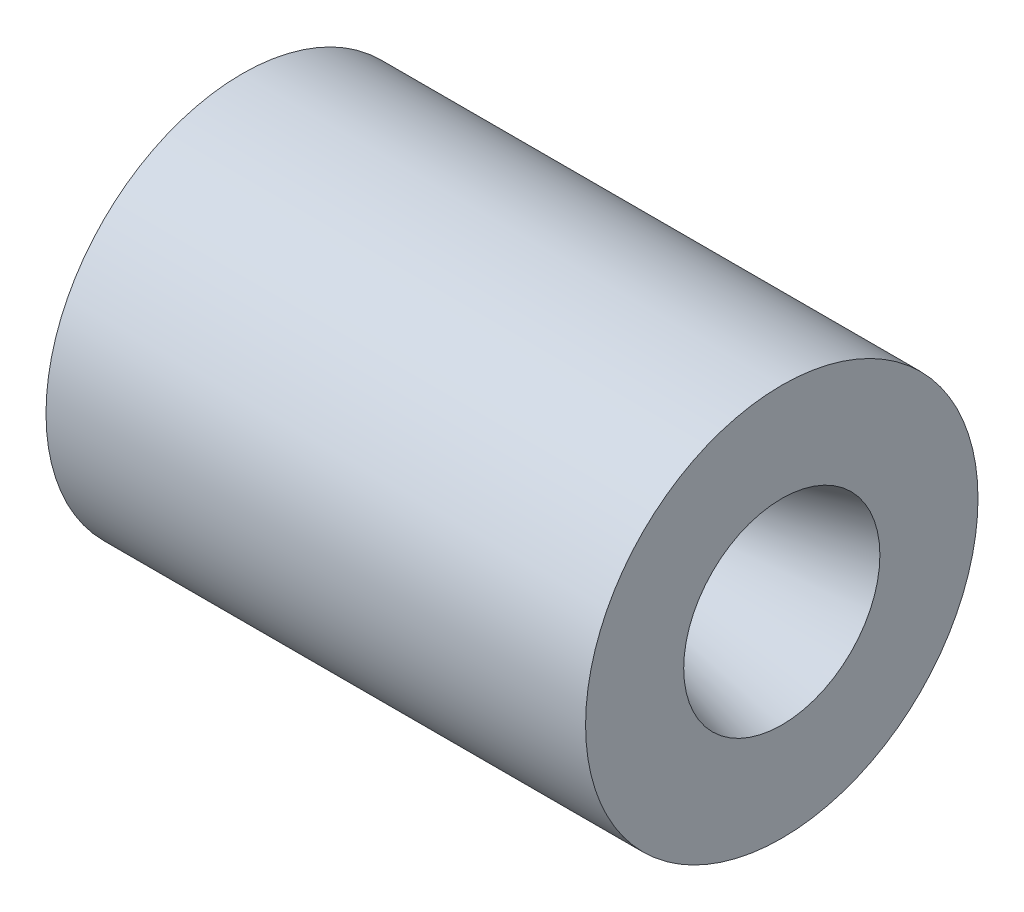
ISO-10303-21;
HEADER;
FILE_DESCRIPTION(('STEP AP214'),'2;1');
FILE_NAME('part.step','',(''),(''),'','','');
FILE_SCHEMA(('AUTOMOTIVE_DESIGN { 1 0 10303 214 1 1 1 1 }'));
ENDSEC;
DATA;
#1=APPLICATION_CONTEXT('core data for automotive mechanical design processes');
#2=APPLICATION_PROTOCOL_DEFINITION('international standard','automotive_design',2000,#1);
#3=PRODUCT_CONTEXT('',#1,'mechanical');
#4=PRODUCT('Part','Part','',(#3));
#5=PRODUCT_RELATED_PRODUCT_CATEGORY('part','',(#4));
#6=PRODUCT_DEFINITION_FORMATION('','',#4);
#7=PRODUCT_DEFINITION_CONTEXT('part definition',#1,'design');
#8=PRODUCT_DEFINITION('design','',#6,#7);
#9=PRODUCT_DEFINITION_SHAPE('','',#8);
#10=(LENGTH_UNIT() NAMED_UNIT(*) SI_UNIT(.MILLI.,.METRE.));
#11=(NAMED_UNIT(*) PLANE_ANGLE_UNIT() SI_UNIT($,.RADIAN.));
#12=(NAMED_UNIT(*) SI_UNIT($,.STERADIAN.) SOLID_ANGLE_UNIT());
#13=UNCERTAINTY_MEASURE_WITH_UNIT(LENGTH_MEASURE(1.E-05),#10,'distance_accuracy_value','');
#14=(GEOMETRIC_REPRESENTATION_CONTEXT(3) GLOBAL_UNCERTAINTY_ASSIGNED_CONTEXT((#13)) GLOBAL_UNIT_ASSIGNED_CONTEXT((#10,
#11,#12)) REPRESENTATION_CONTEXT('',''));
#15=CARTESIAN_POINT('',(0.,0.,0.));
#16=DIRECTION('',(0.,0.,1.));
#17=DIRECTION('',(1.,0.,0.));
#18=AXIS2_PLACEMENT_3D('',#15,#16,#17);
#19=CARTESIAN_POINT('',(4.23603870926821,2.,0.));
#20=DIRECTION('',(-1.,0.,0.));
#21=DIRECTION('',(0.,0.,1.));
#22=AXIS2_PLACEMENT_3D('',#19,#20,#21);
#23=PLANE('',#22);
#24=CARTESIAN_POINT('',(4.23603870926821,0.,0.));
#25=DIRECTION('',(-1.,0.,0.));
#26=DIRECTION('',(0.,0.,1.));
#27=AXIS2_PLACEMENT_3D('',#24,#25,#26);
#28=CIRCLE('',#27,2.);
#29=CARTESIAN_POINT('',(4.23603870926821,0.,2.));
#30=VERTEX_POINT('',#29);
#31=EDGE_CURVE('E55',#30,#30,#28,.T.);
#32=ORIENTED_EDGE('',*,*,#31,.F.);
#33=EDGE_LOOP('',(#32));
#34=FACE_BOUND('',#33,.T.);
#35=CARTESIAN_POINT('',(4.23603870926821,0.,0.));
#36=DIRECTION('',(-1.,0.,0.));
#37=DIRECTION('',(0.,0.,1.));
#38=AXIS2_PLACEMENT_3D('',#35,#36,#37);
#39=CIRCLE('',#38,1.);
#40=CARTESIAN_POINT('',(4.23603870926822,0.,-1.));
#41=VERTEX_POINT('',#40);
#42=EDGE_CURVE('E10',#41,#41,#39,.T.);
#43=ORIENTED_EDGE('',*,*,#42,.T.);
#44=EDGE_LOOP('',(#43));
#45=FACE_BOUND('',#44,.T.);
#46=ADVANCED_FACE('F30',(#34,#45),#23,.F.);
#47=CARTESIAN_POINT('',(0.87719298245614,0.,0.));
#48=DIRECTION('',(1.,0.,0.));
#49=DIRECTION('',(0.,0.,-1.));
#50=AXIS2_PLACEMENT_3D('',#47,#48,#49);
#51=CONICAL_SURFACE('',#50,0.1,0.261799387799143);
#52=CARTESIAN_POINT('',(0.87719298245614,0.,0.));
#53=DIRECTION('',(-1.,0.,0.));
#54=DIRECTION('',(0.,0.,1.));
#55=AXIS2_PLACEMENT_3D('',#52,#53,#54);
#56=CIRCLE('',#55,0.1);
#57=CARTESIAN_POINT('',(0.87719298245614,0.,-0.1));
#58=VERTEX_POINT('',#57);
#59=EDGE_CURVE('E36',#58,#58,#56,.T.);
#60=CARTESIAN_POINT('',(4.23603870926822,0.,-1.));
#61=CARTESIAN_POINT('',(4.20105073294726,0.,-0.990625));
#62=CARTESIAN_POINT('',(4.1660627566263,0.,-0.98125));
#63=CARTESIAN_POINT('',(4.09608680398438,0.,-0.9625));
#64=CARTESIAN_POINT('',(4.06109882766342,0.,-0.953125));
#65=CARTESIAN_POINT('',(3.9911228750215,0.,-0.934375));
#66=CARTESIAN_POINT('',(3.95613489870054,0.,-0.925));
#67=CARTESIAN_POINT('',(3.88615894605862,0.,-0.90625));
#68=CARTESIAN_POINT('',(3.85117096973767,0.,-0.896875));
#69=CARTESIAN_POINT('',(3.78119501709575,0.,-0.878125));
#70=CARTESIAN_POINT('',(3.74620704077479,0.,-0.86875));
#71=CARTESIAN_POINT('',(3.67623108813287,0.,-0.85));
#72=CARTESIAN_POINT('',(3.64124311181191,0.,-0.840625));
#73=CARTESIAN_POINT('',(3.57126715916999,0.,-0.821875));
#74=CARTESIAN_POINT('',(3.53627918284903,0.,-0.8125));
#75=CARTESIAN_POINT('',(3.46630323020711,0.,-0.79375));
#76=CARTESIAN_POINT('',(3.43131525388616,0.,-0.784375));
#77=CARTESIAN_POINT('',(3.36133930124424,0.,-0.765625));
#78=CARTESIAN_POINT('',(3.32635132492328,0.,-0.75625));
#79=CARTESIAN_POINT('',(3.25637537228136,0.,-0.7375));
#80=CARTESIAN_POINT('',(3.2213873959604,0.,-0.728125));
#81=CARTESIAN_POINT('',(3.15141144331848,0.,-0.709375));
#82=CARTESIAN_POINT('',(3.11642346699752,0.,-0.7));
#83=CARTESIAN_POINT('',(3.04644751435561,0.,-0.68125));
#84=CARTESIAN_POINT('',(3.01145953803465,0.,-0.671875));
#85=CARTESIAN_POINT('',(2.94148358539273,0.,-0.653125));
#86=CARTESIAN_POINT('',(2.90649560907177,0.,-0.64375));
#87=CARTESIAN_POINT('',(2.83651965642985,0.,-0.625));
#88=CARTESIAN_POINT('',(2.80153168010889,0.,-0.615625));
#89=CARTESIAN_POINT('',(2.73155572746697,0.,-0.596875));
#90=CARTESIAN_POINT('',(2.69656775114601,0.,-0.5875));
#91=CARTESIAN_POINT('',(2.6265917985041,0.,-0.56875));
#92=CARTESIAN_POINT('',(2.59160382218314,0.,-0.559375));
#93=CARTESIAN_POINT('',(2.52162786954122,0.,-0.540625));
#94=CARTESIAN_POINT('',(2.48663989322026,0.,-0.53125));
#95=CARTESIAN_POINT('',(2.41666394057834,0.,-0.5125));
#96=CARTESIAN_POINT('',(2.38167596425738,0.,-0.503125));
#97=CARTESIAN_POINT('',(2.31170001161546,0.,-0.484375));
#98=CARTESIAN_POINT('',(2.2767120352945,0.,-0.475));
#99=CARTESIAN_POINT('',(2.20673608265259,0.,-0.45625));
#100=CARTESIAN_POINT('',(2.17174810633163,0.,-0.446875));
#101=CARTESIAN_POINT('',(2.10177215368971,0.,-0.428125));
#102=CARTESIAN_POINT('',(2.06678417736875,0.,-0.41875));
#103=CARTESIAN_POINT('',(1.99680822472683,0.,-0.4));
#104=CARTESIAN_POINT('',(1.96182024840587,0.,-0.390625));
#105=CARTESIAN_POINT('',(1.89184429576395,0.,-0.371875));
#106=CARTESIAN_POINT('',(1.856856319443,0.,-0.3625));
#107=CARTESIAN_POINT('',(1.78688036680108,0.,-0.34375));
#108=CARTESIAN_POINT('',(1.75189239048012,0.,-0.334375));
#109=CARTESIAN_POINT('',(1.6819164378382,0.,-0.315625));
#110=CARTESIAN_POINT('',(1.64692846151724,0.,-0.30625));
#111=CARTESIAN_POINT('',(1.57695250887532,0.,-0.2875));
#112=CARTESIAN_POINT('',(1.54196453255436,0.,-0.278125));
#113=CARTESIAN_POINT('',(1.47198857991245,0.,-0.259375));
#114=CARTESIAN_POINT('',(1.43700060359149,0.,-0.25));
#115=CARTESIAN_POINT('',(1.36702465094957,0.,-0.23125));
#116=CARTESIAN_POINT('',(1.33203667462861,0.,-0.221875));
#117=CARTESIAN_POINT('',(1.26206072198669,0.,-0.203125));
#118=CARTESIAN_POINT('',(1.22707274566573,0.,-0.19375));
#119=CARTESIAN_POINT('',(1.15709679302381,0.,-0.175));
#120=CARTESIAN_POINT('',(1.12210881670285,0.,-0.165625));
#121=CARTESIAN_POINT('',(1.05213286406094,0.,-0.146875));
#122=CARTESIAN_POINT('',(1.01714488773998,0.,-0.1375));
#123=CARTESIAN_POINT('',(0.947168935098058,0.,-0.11875));
#124=CARTESIAN_POINT('',(0.912180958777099,0.,-0.109375));
#125=CARTESIAN_POINT('',(0.87719298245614,0.,-0.1));
#126=B_SPLINE_CURVE_WITH_KNOTS('',3,(#60,#61,#62,#63,#64,#65,#66,#67,#68,#69,#70,#71,#72,#73,
#74,#75,#76,#77,#78,#79,#80,#81,#82,#83,#84,#85,#86,#87,#88,#89,#90,#91,#92,#93,#94,#95,#96,#97,
#98,#99,#100,#101,#102,#103,#104,#105,#106,#107,#108,#109,#110,#111,#112,#113,#114,#115,#116,
#117,#118,#119,#120,#121,#122,#123,#124,#125),.UNSPECIFIED.,.F.,.F.,(4,2,2,2,2,2,2,2,2,2,2,2,2,
2,2,2,2,2,2,2,2,2,2,2,2,2,2,2,2,2,2,2,4),(0.,0.108666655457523,0.217333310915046,
0.325999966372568,0.434666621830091,0.543333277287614,0.651999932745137,0.76066658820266,
0.869333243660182,0.977999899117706,1.08666655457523,1.19533321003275,1.30399986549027,
1.4126665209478,1.52133317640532,1.62999983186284,1.73866648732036,1.84733314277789,
1.95599979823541,2.06466645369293,2.17333310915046,2.28199976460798,2.3906664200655,
2.49933307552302,2.60799973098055,2.71666638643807,2.82533304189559,2.93399969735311,
3.04266635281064,3.15133300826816,3.25999966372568,3.3686663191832,3.47733297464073),.UNSPECIFIED.);
#127=EDGE_CURVE('BSEAM62',#41,#58,#126,.T.);
#128=ORIENTED_EDGE('',*,*,#42,.F.);
#129=ORIENTED_EDGE('',*,*,#59,.T.);
#130=ORIENTED_EDGE('',*,*,#127,.T.);
#131=ORIENTED_EDGE('',*,*,#127,.F.);
#132=EDGE_LOOP('',(#128,#130,#129,#131));
#133=FACE_BOUND('',#132,.T.);
#134=ADVANCED_FACE('F62',(#133),#51,.F.);
#135=CARTESIAN_POINT('',(-0.530912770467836,0.,0.));
#136=DIRECTION('',(-1.,0.,0.));
#137=DIRECTION('',(0.,0.,1.));
#138=AXIS2_PLACEMENT_3D('',#135,#136,#137);
#139=CYLINDRICAL_SURFACE('',#138,0.1);
#140=ORIENTED_EDGE('',*,*,#59,.F.);
#141=EDGE_LOOP('',(#140));
#142=FACE_BOUND('',#141,.T.);
#143=CARTESIAN_POINT('',(0.67719298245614,0.,0.));
#144=DIRECTION('',(-1.,0.,0.));
#145=DIRECTION('',(0.,0.,1.));
#146=AXIS2_PLACEMENT_3D('',#143,#144,#145);
#147=CIRCLE('',#146,0.1);
#148=CARTESIAN_POINT('',(0.67719298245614,0.,0.1));
#149=VERTEX_POINT('',#148);
#150=EDGE_CURVE('E40',#149,#149,#147,.T.);
#151=ORIENTED_EDGE('',*,*,#150,.T.);
#152=EDGE_LOOP('',(#151));
#153=FACE_BOUND('',#152,.T.);
#154=ADVANCED_FACE('F66',(#142,#153),#139,.F.);
#155=CARTESIAN_POINT('',(-0.0137512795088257,0.,0.));
#156=DIRECTION('',(-1.,0.,0.));
#157=DIRECTION('',(0.,0.,1.));
#158=AXIS2_PLACEMENT_3D('',#155,#156,#157);
#159=CONICAL_SURFACE('',#158,1.2499243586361,1.02974425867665);
#160=CARTESIAN_POINT('',(-0.0137512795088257,0.,0.));
#161=DIRECTION('',(-1.,0.,0.));
#162=DIRECTION('',(0.,0.,1.));
#163=AXIS2_PLACEMENT_3D('',#160,#161,#162);
#164=CIRCLE('',#163,1.2499243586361);
#165=CARTESIAN_POINT('',(-0.0137512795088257,0.,1.2499243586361));
#166=VERTEX_POINT('',#165);
#167=EDGE_CURVE('E44',#166,#166,#164,.T.);
#168=CARTESIAN_POINT('',(0.67719298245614,0.,0.1));
#169=CARTESIAN_POINT('',(0.669995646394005,0.,0.111978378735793));
#170=CARTESIAN_POINT('',(0.66279831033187,0.,0.123956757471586));
#171=CARTESIAN_POINT('',(0.6484036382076,0.,0.147913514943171));
#172=CARTESIAN_POINT('',(0.641206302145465,0.,0.159891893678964));
#173=CARTESIAN_POINT('',(0.626811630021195,0.,0.183848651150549));
#174=CARTESIAN_POINT('',(0.61961429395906,0.,0.195827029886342));
#175=CARTESIAN_POINT('',(0.60521962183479,0.,0.219783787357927));
#176=CARTESIAN_POINT('',(0.598022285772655,0.,0.23176216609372));
#177=CARTESIAN_POINT('',(0.583627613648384,0.,0.255718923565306));
#178=CARTESIAN_POINT('',(0.576430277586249,0.,0.267697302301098));
#179=CARTESIAN_POINT('',(0.562035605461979,0.,0.291654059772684));
#180=CARTESIAN_POINT('',(0.554838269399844,0.,0.303632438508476));
#181=CARTESIAN_POINT('',(0.540443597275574,0.,0.327589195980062));
#182=CARTESIAN_POINT('',(0.533246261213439,0.,0.339567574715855));
#183=CARTESIAN_POINT('',(0.518851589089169,0.,0.36352433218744));
#184=CARTESIAN_POINT('',(0.511654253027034,0.,0.375502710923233));
#185=CARTESIAN_POINT('',(0.497259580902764,0.,0.399459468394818));
#186=CARTESIAN_POINT('',(0.490062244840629,0.,0.411437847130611));
#187=CARTESIAN_POINT('',(0.475667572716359,0.,0.435394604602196));
#188=CARTESIAN_POINT('',(0.468470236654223,0.,0.447372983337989));
#189=CARTESIAN_POINT('',(0.454075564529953,0.,0.471329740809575));
#190=CARTESIAN_POINT('',(0.446878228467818,0.,0.483308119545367));
#191=CARTESIAN_POINT('',(0.432483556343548,0.,0.507264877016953));
#192=CARTESIAN_POINT('',(0.425286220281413,0.,0.519243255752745));
#193=CARTESIAN_POINT('',(0.410891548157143,0.,0.543200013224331));
#194=CARTESIAN_POINT('',(0.403694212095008,0.,0.555178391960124));
#195=CARTESIAN_POINT('',(0.389299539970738,0.,0.579135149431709));
#196=CARTESIAN_POINT('',(0.382102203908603,0.,0.591113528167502));
#197=CARTESIAN_POINT('',(0.367707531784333,0.,0.615070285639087));
#198=CARTESIAN_POINT('',(0.360510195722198,0.,0.62704866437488));
#199=CARTESIAN_POINT('',(0.346115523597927,0.,0.651005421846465));
#200=CARTESIAN_POINT('',(0.338918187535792,0.,0.662983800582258));
#201=CARTESIAN_POINT('',(0.324523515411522,0.,0.686940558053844));
#202=CARTESIAN_POINT('',(0.317326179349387,0.,0.698918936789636));
#203=CARTESIAN_POINT('',(0.302931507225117,0.,0.722875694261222));
#204=CARTESIAN_POINT('',(0.295734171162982,0.,0.734854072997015));
#205=CARTESIAN_POINT('',(0.281339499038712,0.,0.7588108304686));
#206=CARTESIAN_POINT('',(0.274142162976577,0.,0.770789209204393));
#207=CARTESIAN_POINT('',(0.259747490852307,0.,0.794745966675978));
#208=CARTESIAN_POINT('',(0.252550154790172,0.,0.806724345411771));
#209=CARTESIAN_POINT('',(0.238155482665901,0.,0.830681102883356));
#210=CARTESIAN_POINT('',(0.230958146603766,0.,0.842659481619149));
#211=CARTESIAN_POINT('',(0.216563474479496,0.,0.866616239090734));
#212=CARTESIAN_POINT('',(0.209366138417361,0.,0.878594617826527));
#213=CARTESIAN_POINT('',(0.194971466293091,0.,0.902551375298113));
#214=CARTESIAN_POINT('',(0.187774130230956,0.,0.914529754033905));
#215=CARTESIAN_POINT('',(0.173379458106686,0.,0.938486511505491));
#216=CARTESIAN_POINT('',(0.166182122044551,0.,0.950464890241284));
#217=CARTESIAN_POINT('',(0.151787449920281,0.,0.974421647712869));
#218=CARTESIAN_POINT('',(0.144590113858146,0.,0.986400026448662));
#219=CARTESIAN_POINT('',(0.130195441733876,0.,1.01035678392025));
#220=CARTESIAN_POINT('',(0.122998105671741,0.,1.02233516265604));
#221=CARTESIAN_POINT('',(0.10860343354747,0.,1.04629192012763));
#222=CARTESIAN_POINT('',(0.101406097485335,0.,1.05827029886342));
#223=CARTESIAN_POINT('',(0.0870114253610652,0.,1.082227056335));
#224=CARTESIAN_POINT('',(0.0798140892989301,0.,1.0942054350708));
#225=CARTESIAN_POINT('',(0.06541941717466,0.,1.11816219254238));
#226=CARTESIAN_POINT('',(0.0582220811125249,0.,1.13014057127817));
#227=CARTESIAN_POINT('',(0.0438274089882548,0.,1.15409732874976));
#228=CARTESIAN_POINT('',(0.0366300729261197,0.,1.16607570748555));
#229=CARTESIAN_POINT('',(0.0222354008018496,0.,1.19003246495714));
#230=CARTESIAN_POINT('',(0.0150380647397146,0.,1.20201084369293));
#231=CARTESIAN_POINT('',(0.000643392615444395,0.,1.22596760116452));
#232=CARTESIAN_POINT('',(-0.00655394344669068,0.,1.23794597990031));
#233=CARTESIAN_POINT('',(-0.0137512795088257,0.,1.2499243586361));
#234=B_SPLINE_CURVE_WITH_KNOTS('',3,(#168,#169,#170,#171,#172,#173,#174,#175,#176,#177,#178,
#179,#180,#181,#182,#183,#184,#185,#186,#187,#188,#189,#190,#191,#192,#193,#194,#195,#196,#197,
#198,#199,#200,#201,#202,#203,#204,#205,#206,#207,#208,#209,#210,#211,#212,#213,#214,#215,#216,
#217,#218,#219,#220,#221,#222,#223,#224,#225,#226,#227,#228,#229,#230,#231,#232,#233),
.UNSPECIFIED.,.F.,.F.,(4,2,2,2,2,2,2,2,2,2,2,2,2,2,2,2,2,2,2,2,2,2,2,2,2,2,2,2,2,2,2,2,4),(0.,
0.0419231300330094,0.0838462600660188,0.125769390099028,0.167692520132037,0.209615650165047,
0.251538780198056,0.293461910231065,0.335385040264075,0.377308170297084,0.419231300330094,
0.461154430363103,0.503077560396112,0.545000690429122,0.586923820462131,0.62884695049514,
0.67077008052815,0.712693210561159,0.754616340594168,0.796539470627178,0.838462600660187,
0.880385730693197,0.922308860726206,0.964231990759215,1.00615512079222,1.04807825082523,
1.09000138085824,1.13192451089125,1.17384764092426,1.21577077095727,1.25769390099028,
1.29961703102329,1.3415401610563),.UNSPECIFIED.);
#235=EDGE_CURVE('BSEAM71',#149,#166,#234,.T.);
#236=ORIENTED_EDGE('',*,*,#150,.F.);
#237=ORIENTED_EDGE('',*,*,#167,.T.);
#238=ORIENTED_EDGE('',*,*,#235,.T.);
#239=ORIENTED_EDGE('',*,*,#235,.F.);
#240=EDGE_LOOP('',(#236,#238,#237,#239));
#241=FACE_BOUND('',#240,.T.);
#242=ADVANCED_FACE('F71',(#241),#159,.F.);
#243=CARTESIAN_POINT('',(-0.530912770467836,0.,0.));
#244=DIRECTION('',(-1.,0.,0.));
#245=DIRECTION('',(0.,0.,1.));
#246=AXIS2_PLACEMENT_3D('',#243,#244,#245);
#247=CYLINDRICAL_SURFACE('',#246,1.2499243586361);
#248=ORIENTED_EDGE('',*,*,#167,.F.);
#249=EDGE_LOOP('',(#248));
#250=FACE_BOUND('',#249,.T.);
#251=CARTESIAN_POINT('',(-1.26396129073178,0.,0.));
#252=DIRECTION('',(-1.,0.,0.));
#253=DIRECTION('',(0.,0.,1.));
#254=AXIS2_PLACEMENT_3D('',#251,#252,#253);
#255=CIRCLE('',#254,1.2499243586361);
#256=CARTESIAN_POINT('',(-1.26396129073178,0.,1.2499243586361));
#257=VERTEX_POINT('',#256);
#258=EDGE_CURVE('E49',#257,#257,#255,.T.);
#259=ORIENTED_EDGE('',*,*,#258,.T.);
#260=EDGE_LOOP('',(#259));
#261=FACE_BOUND('',#260,.T.);
#262=ADVANCED_FACE('F77',(#250,#261),#247,.F.);
#263=CARTESIAN_POINT('',(-1.26396129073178,2.,0.));
#264=DIRECTION('',(1.,0.,0.));
#265=DIRECTION('',(0.,0.,-1.));
#266=AXIS2_PLACEMENT_3D('',#263,#264,#265);
#267=PLANE('',#266);
#268=ORIENTED_EDGE('',*,*,#258,.F.);
#269=EDGE_LOOP('',(#268));
#270=FACE_BOUND('',#269,.T.);
#271=CARTESIAN_POINT('',(-1.26396129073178,0.,0.));
#272=DIRECTION('',(-1.,0.,0.));
#273=DIRECTION('',(0.,0.,1.));
#274=AXIS2_PLACEMENT_3D('',#271,#272,#273);
#275=CIRCLE('',#274,2.);
#276=CARTESIAN_POINT('',(-1.26396129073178,0.,2.));
#277=VERTEX_POINT('',#276);
#278=EDGE_CURVE('E52',#277,#277,#275,.T.);
#279=ORIENTED_EDGE('',*,*,#278,.T.);
#280=EDGE_LOOP('',(#279));
#281=FACE_BOUND('',#280,.T.);
#282=ADVANCED_FACE('F81',(#270,#281),#267,.F.);
#283=CARTESIAN_POINT('',(-0.530912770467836,0.,0.));
#284=DIRECTION('',(-1.,0.,0.));
#285=DIRECTION('',(0.,0.,1.));
#286=AXIS2_PLACEMENT_3D('',#283,#284,#285);
#287=CYLINDRICAL_SURFACE('',#286,2.);
#288=ORIENTED_EDGE('',*,*,#278,.F.);
#289=EDGE_LOOP('',(#288));
#290=FACE_BOUND('',#289,.T.);
#291=ORIENTED_EDGE('',*,*,#31,.T.);
#292=EDGE_LOOP('',(#291));
#293=FACE_BOUND('',#292,.T.);
#294=ADVANCED_FACE('F59',(#290,#293),#287,.T.);
#295=CLOSED_SHELL('',(#46,#134,#154,#242,#262,#282,#294));
#296=MANIFOLD_SOLID_BREP('B2',#295);
#297=ADVANCED_BREP_SHAPE_REPRESENTATION('',(#18,#296),#14);
#298=SHAPE_DEFINITION_REPRESENTATION(#9,#297);
ENDSEC;
END-ISO-10303-21;
